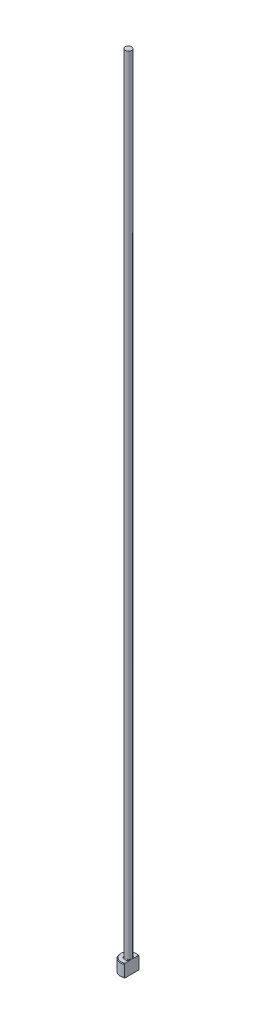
from build123d import *
from build123d.topology import SkipClean

# Parameters (mm, degrees)
CHAMFER1_SIZE    = 0.2
FILLET1_R        = 0.2
KEYED_HEAD_DEPTH = 251.02499875


with BuildPart() as part:
    # Sketch1 → Revolve1 (revolve)
    with BuildSketch(Plane.XY, mode=Mode.PRIVATE) as revolve1_sk:
        Polygon((0, 0), (-2.5, 0), (-2.5, 4), (-1, 4), (-1, 250), (0, 250), align=None)
    revolve(revolve1_sk.sketch.rotate(Axis((0, 259.958771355, 0), (0, -1, 0)), 270), axis=Axis((0, 259.958771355, 0), (0, -1, 0)))

    # Chamfer1
    chamfer1_edges = [part.edges().sort_by_distance(p)[0] for p in [
        (0, 4, -2.5),
        (0, 0, -2.5),
    ]]
    chamfer(chamfer1_edges, length=CHAMFER1_SIZE)

    # Fillet1
    fillet1_edges = [part.edges().sort_by_distance(p)[0] for p in [
        (0, 4, -1),
    ]]
    fillet(fillet1_edges, radius=FILLET1_R)

    # Sketch2 → KEYED HEAD (cut, through all)
    with SkipClean():  # the faces are left unmerged after this step: merging them gives an invalid solid
        with BuildSketch(Plane(origin=(0, 0, 0), x_dir=(1, 0, 0), z_dir=(0, 1, 0))):
            with BuildLine():
                Line((1, -2.291287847), (1, 2.291287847))
                ThreePointArc((1, 2.291287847), (2.5, 0), (1, -2.291287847))
            make_face()
        extrude(amount=KEYED_HEAD_DEPTH, mode=Mode.SUBTRACT)


solid = part.part
